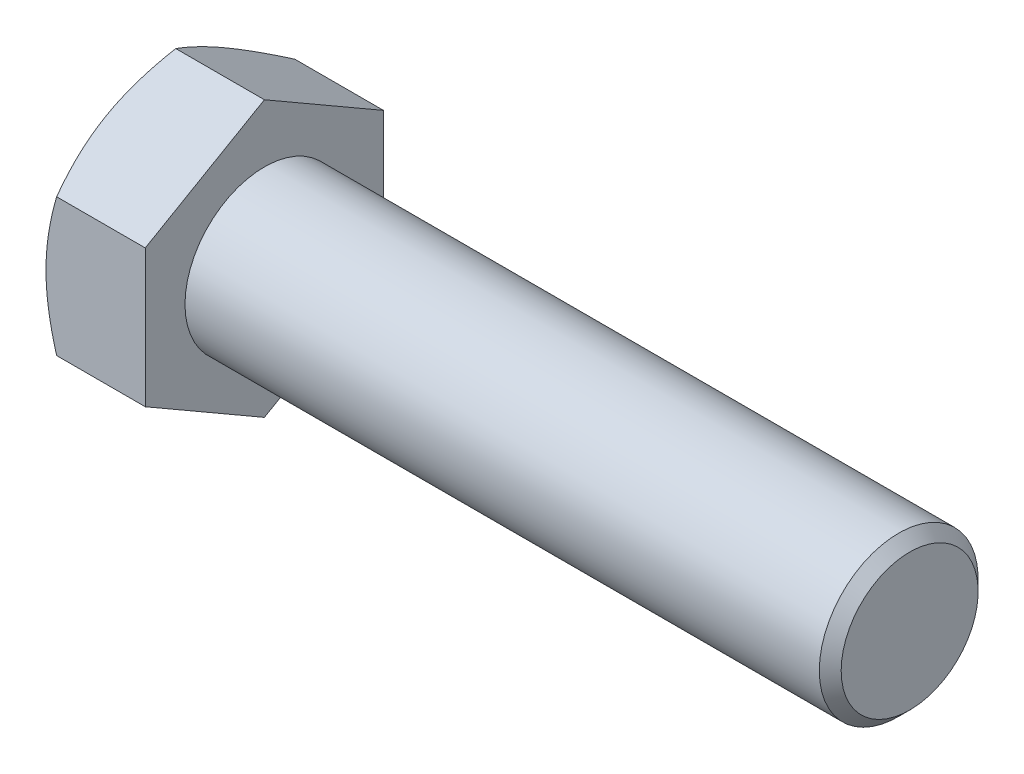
ISO-10303-21;
HEADER;
FILE_DESCRIPTION(('STEP AP214'),'2;1');
FILE_NAME('part.step','',(''),(''),'','','');
FILE_SCHEMA(('AUTOMOTIVE_DESIGN { 1 0 10303 214 1 1 1 1 }'));
ENDSEC;
DATA;
#1=APPLICATION_CONTEXT('core data for automotive mechanical design processes');
#2=APPLICATION_PROTOCOL_DEFINITION('international standard','automotive_design',2000,#1);
#3=PRODUCT_CONTEXT('',#1,'mechanical');
#4=PRODUCT('Part','Part','',(#3));
#5=PRODUCT_RELATED_PRODUCT_CATEGORY('part','',(#4));
#6=PRODUCT_DEFINITION_FORMATION('','',#4);
#7=PRODUCT_DEFINITION_CONTEXT('part definition',#1,'design');
#8=PRODUCT_DEFINITION('design','',#6,#7);
#9=PRODUCT_DEFINITION_SHAPE('','',#8);
#10=(LENGTH_UNIT() NAMED_UNIT(*) SI_UNIT(.MILLI.,.METRE.));
#11=(NAMED_UNIT(*) PLANE_ANGLE_UNIT() SI_UNIT($,.RADIAN.));
#12=(NAMED_UNIT(*) SI_UNIT($,.STERADIAN.) SOLID_ANGLE_UNIT());
#13=UNCERTAINTY_MEASURE_WITH_UNIT(LENGTH_MEASURE(1.E-05),#10,'distance_accuracy_value','');
#14=(GEOMETRIC_REPRESENTATION_CONTEXT(3) GLOBAL_UNCERTAINTY_ASSIGNED_CONTEXT((#13)) GLOBAL_UNIT_ASSIGNED_CONTEXT((#10,
#11,#12)) REPRESENTATION_CONTEXT('',''));
#15=CARTESIAN_POINT('',(0.,0.,0.));
#16=DIRECTION('',(0.,0.,1.));
#17=DIRECTION('',(1.,0.,0.));
#18=AXIS2_PLACEMENT_3D('',#15,#16,#17);
#19=CARTESIAN_POINT('',(1.11022302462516E-13,13.8564064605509,0.));
#20=DIRECTION('',(1.,0.,0.));
#21=DIRECTION('',(0.,0.,-0.999999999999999));
#22=AXIS2_PLACEMENT_3D('',#19,#20,#21);
#23=PLANE('',#22);
#24=CARTESIAN_POINT('',(0.,0.,0.));
#25=DIRECTION('',(1.,0.,0.));
#26=DIRECTION('',(0.,0.,-0.999999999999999));
#27=AXIS2_PLACEMENT_3D('',#24,#25,#26);
#28=CIRCLE('',#27,12.);
#29=CARTESIAN_POINT('',(0.,-10.3923048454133,-6.00000000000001));
#30=VERTEX_POINT('',#29);
#31=CARTESIAN_POINT('',(0.,0.,-12.));
#32=VERTEX_POINT('',#31);
#33=EDGE_CURVE('E339',#30,#32,#28,.T.);
#34=ORIENTED_EDGE('',*,*,#33,.F.);
#35=CARTESIAN_POINT('',(0.,0.,0.));
#36=DIRECTION('',(1.,0.,0.));
#37=DIRECTION('',(0.,0.,-0.999999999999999));
#38=AXIS2_PLACEMENT_3D('',#35,#36,#37);
#39=CIRCLE('',#38,12.);
#40=CARTESIAN_POINT('',(0.,-10.3923048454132,6.00000000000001));
#41=VERTEX_POINT('',#40);
#42=EDGE_CURVE('E338',#41,#30,#39,.T.);
#43=ORIENTED_EDGE('',*,*,#42,.F.);
#44=CARTESIAN_POINT('',(0.,0.,0.));
#45=DIRECTION('',(1.,0.,0.));
#46=DIRECTION('',(0.,0.,-0.999999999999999));
#47=AXIS2_PLACEMENT_3D('',#44,#45,#46);
#48=CIRCLE('',#47,12.);
#49=CARTESIAN_POINT('',(0.,0.,12.0000000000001));
#50=VERTEX_POINT('',#49);
#51=EDGE_CURVE('E88',#50,#41,#48,.T.);
#52=ORIENTED_EDGE('',*,*,#51,.F.);
#53=CARTESIAN_POINT('',(0.,0.,0.));
#54=DIRECTION('',(1.,0.,0.));
#55=DIRECTION('',(0.,0.,-0.999999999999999));
#56=AXIS2_PLACEMENT_3D('',#53,#54,#55);
#57=CIRCLE('',#56,12.);
#58=CARTESIAN_POINT('',(0.,10.3923048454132,6.00000000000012));
#59=VERTEX_POINT('',#58);
#60=EDGE_CURVE('E86',#59,#50,#57,.T.);
#61=ORIENTED_EDGE('',*,*,#60,.F.);
#62=CARTESIAN_POINT('',(0.,0.,0.));
#63=DIRECTION('',(1.,0.,0.));
#64=DIRECTION('',(0.,0.,-0.999999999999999));
#65=AXIS2_PLACEMENT_3D('',#62,#63,#64);
#66=CIRCLE('',#65,12.);
#67=CARTESIAN_POINT('',(0.,10.3923048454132,-6.00000000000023));
#68=VERTEX_POINT('',#67);
#69=EDGE_CURVE('E19',#68,#59,#66,.T.);
#70=ORIENTED_EDGE('',*,*,#69,.F.);
#71=CARTESIAN_POINT('',(0.,0.,0.));
#72=DIRECTION('',(1.,0.,0.));
#73=DIRECTION('',(0.,0.,-0.999999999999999));
#74=AXIS2_PLACEMENT_3D('',#71,#72,#73);
#75=CIRCLE('',#74,12.);
#76=EDGE_CURVE('E264',#32,#68,#75,.T.);
#77=ORIENTED_EDGE('',*,*,#76,.F.);
#78=EDGE_LOOP('',(#34,#43,#52,#61,#70,#77));
#79=FACE_BOUND('',#78,.T.);
#80=ADVANCED_FACE('F16',(#79),#23,.F.);
#81=CARTESIAN_POINT('',(1.07822755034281,0.,0.));
#82=DIRECTION('',(1.,0.,0.));
#83=DIRECTION('',(0.,0.,-0.999999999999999));
#84=AXIS2_PLACEMENT_3D('',#81,#82,#83);
#85=CONICAL_SURFACE('',#84,13.8675448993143,1.0471975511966);
#86=CARTESIAN_POINT('',(1.07179676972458,13.856406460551,0.));
#87=CARTESIAN_POINT('',(0.908940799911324,13.5743006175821,-0.488621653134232));
#88=CARTESIAN_POINT('',(0.759755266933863,13.2901242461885,-0.980829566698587));
#89=CARTESIAN_POINT('',(0.562274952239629,12.8616146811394,-1.72302990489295));
#90=CARTESIAN_POINT('',(0.500950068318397,12.7187583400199,-1.97046434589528));
#91=CARTESIAN_POINT('',(0.387776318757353,12.4321091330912,-2.46695533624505));
#92=CARTESIAN_POINT('',(0.335926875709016,12.2883163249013,-2.71601178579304));
#93=CARTESIAN_POINT('',(0.242530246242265,11.9997152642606,-3.21588348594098));
#94=CARTESIAN_POINT('',(0.200995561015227,11.8549059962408,-3.46670049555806));
#95=CARTESIAN_POINT('',(0.129101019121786,11.5645948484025,-3.96953415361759));
#96=CARTESIAN_POINT('',(0.0987408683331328,11.4190929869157,-4.2215507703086));
#97=CARTESIAN_POINT('',(0.0497242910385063,11.1268576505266,-4.72771722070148));
#98=CARTESIAN_POINT('',(0.0311273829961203,10.9801216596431,-4.98187141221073));
#99=CARTESIAN_POINT('',(0.00623934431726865,10.6863610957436,-5.49067963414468));
#100=CARTESIAN_POINT('',(-4.93491988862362E-05,10.539336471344,-5.74533375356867));
#101=CARTESIAN_POINT('',(0.,10.3923048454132,-6.00000000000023));
#102=B_SPLINE_CURVE_WITH_KNOTS('',3,(#86,#87,#88,#89,#90,#91,#92,#93,#94,#95,#96,#97,#98,#99,
#100,#101),.UNSPECIFIED.,.F.,.F.,(4,2,2,2,2,2,2,4),(0.,1.76168798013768,2.63822760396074,
3.51471379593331,4.39225713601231,5.26977737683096,6.15170281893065,7.03380287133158),.UNSPECIFIED.);
#103=CARTESIAN_POINT('',(1.07179676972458,13.856406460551,0.));
#104=VERTEX_POINT('',#103);
#105=EDGE_CURVE('E98',#104,#68,#102,.T.);
#106=ORIENTED_EDGE('',*,*,#105,.T.);
#107=ORIENTED_EDGE('',*,*,#69,.T.);
#108=CARTESIAN_POINT('',(0.,10.3923048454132,6.00000000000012));
#109=CARTESIAN_POINT('',(-4.93491989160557E-05,10.5393364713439,5.74533375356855));
#110=CARTESIAN_POINT('',(0.00623934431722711,10.6863610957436,5.49067963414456));
#111=CARTESIAN_POINT('',(0.0311273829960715,10.9801216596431,4.98187141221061));
#112=CARTESIAN_POINT('',(0.0497242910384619,11.1268576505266,4.72771722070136));
#113=CARTESIAN_POINT('',(0.0987408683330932,11.4190929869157,4.22155077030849));
#114=CARTESIAN_POINT('',(0.129101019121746,11.5645948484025,3.96953415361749));
#115=CARTESIAN_POINT('',(0.200995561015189,11.8549059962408,3.46670049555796));
#116=CARTESIAN_POINT('',(0.242530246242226,11.9997152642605,3.21588348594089));
#117=CARTESIAN_POINT('',(0.335926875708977,12.2883163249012,2.71601178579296));
#118=CARTESIAN_POINT('',(0.387776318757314,12.4321091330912,2.46695533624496));
#119=CARTESIAN_POINT('',(0.500950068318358,12.7187583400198,1.9704643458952));
#120=CARTESIAN_POINT('',(0.562274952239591,12.8616146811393,1.72302990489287));
#121=CARTESIAN_POINT('',(0.759755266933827,13.2901242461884,0.980829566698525));
#122=CARTESIAN_POINT('',(0.908940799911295,13.5743006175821,0.488621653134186));
#123=CARTESIAN_POINT('',(1.07179676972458,13.856406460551,0.));
#124=B_SPLINE_CURVE_WITH_KNOTS('',3,(#108,#109,#110,#111,#112,#113,#114,#115,#116,#117,#118,
#119,#120,#121,#122,#123),.UNSPECIFIED.,.F.,.F.,(4,2,2,2,2,2,2,4),(0.,0.882100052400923,
1.7640254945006,2.64154573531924,3.51908907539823,4.39557526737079,5.27211489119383,
7.03380287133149),.UNSPECIFIED.);
#125=EDGE_CURVE('E96',#59,#104,#124,.T.);
#126=ORIENTED_EDGE('',*,*,#125,.T.);
#127=EDGE_LOOP('',(#106,#107,#126));
#128=FACE_BOUND('',#127,.T.);
#129=ADVANCED_FACE('F94',(#128),#85,.T.);
#130=CARTESIAN_POINT('',(1.07822755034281,0.,0.));
#131=DIRECTION('',(1.,0.,0.));
#132=DIRECTION('',(0.,0.,-0.999999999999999));
#133=AXIS2_PLACEMENT_3D('',#130,#131,#132);
#134=CONICAL_SURFACE('',#133,13.8675448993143,1.0471975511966);
#135=CARTESIAN_POINT('',(1.07179676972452,6.92820323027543,11.9999999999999));
#136=CARTESIAN_POINT('',(0.90894079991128,7.21030907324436,11.5113783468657));
#137=CARTESIAN_POINT('',(0.759755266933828,7.494485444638,11.0191704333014));
#138=CARTESIAN_POINT('',(0.562274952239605,7.92299500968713,10.2769700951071));
#139=CARTESIAN_POINT('',(0.500950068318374,8.0658513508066,10.0295356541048));
#140=CARTESIAN_POINT('',(0.387776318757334,8.35250055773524,9.53304466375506));
#141=CARTESIAN_POINT('',(0.335926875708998,8.49629336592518,9.28398821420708));
#142=CARTESIAN_POINT('',(0.242530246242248,8.78489442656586,8.78411651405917));
#143=CARTESIAN_POINT('',(0.200995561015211,8.92970369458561,8.53329950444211));
#144=CARTESIAN_POINT('',(0.129101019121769,9.22001484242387,8.0304658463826));
#145=CARTESIAN_POINT('',(0.0987408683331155,9.36551670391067,7.77844922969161));
#146=CARTESIAN_POINT('',(0.0497242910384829,9.65775204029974,7.27228277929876));
#147=CARTESIAN_POINT('',(0.0311273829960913,9.80448803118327,7.01812858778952));
#148=CARTESIAN_POINT('',(0.00623934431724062,10.0982485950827,6.5093203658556));
#149=CARTESIAN_POINT('',(-4.93491989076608E-05,10.2452732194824,6.25466624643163));
#150=CARTESIAN_POINT('',(0.,10.3923048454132,6.00000000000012));
#151=B_SPLINE_CURVE_WITH_KNOTS('',3,(#135,#136,#137,#138,#139,#140,#141,#142,#143,#144,#145,
#146,#147,#148,#149,#150),.UNSPECIFIED.,.F.,.F.,(4,2,2,2,2,2,2,4),(0.,1.76168798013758,
2.63822760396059,3.51471379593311,4.39225713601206,5.26977737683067,6.15170281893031,
7.03380287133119),.UNSPECIFIED.);
#152=CARTESIAN_POINT('',(1.07179676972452,6.92820323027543,11.9999999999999));
#153=VERTEX_POINT('',#152);
#154=EDGE_CURVE('E101',#153,#59,#151,.T.);
#155=ORIENTED_EDGE('',*,*,#154,.T.);
#156=ORIENTED_EDGE('',*,*,#60,.T.);
#157=CARTESIAN_POINT('',(0.,0.,12.0000000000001));
#158=CARTESIAN_POINT('',(-4.93491989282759E-05,0.294063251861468,12.));
#159=CARTESIAN_POINT('',(0.00623934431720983,0.588112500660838,11.9999999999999));
#160=CARTESIAN_POINT('',(0.0311273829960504,1.17563362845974,11.9999999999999));
#161=CARTESIAN_POINT('',(0.0497242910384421,1.46910561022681,11.9999999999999));
#162=CARTESIAN_POINT('',(0.0987408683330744,2.05357628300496,11.9999999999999));
#163=CARTESIAN_POINT('',(0.129101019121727,2.34458000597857,11.9999999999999));
#164=CARTESIAN_POINT('',(0.200995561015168,2.9252023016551,11.9999999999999));
#165=CARTESIAN_POINT('',(0.242530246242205,3.21482083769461,11.9999999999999));
#166=CARTESIAN_POINT('',(0.335926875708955,3.79202295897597,11.9999999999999));
#167=CARTESIAN_POINT('',(0.387776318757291,4.07960857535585,11.9999999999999));
#168=CARTESIAN_POINT('',(0.500950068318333,4.65290698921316,11.9999999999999));
#169=CARTESIAN_POINT('',(0.562274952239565,4.93861967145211,11.9999999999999));
#170=CARTESIAN_POINT('',(0.759755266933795,5.79563880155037,11.9999999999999));
#171=CARTESIAN_POINT('',(0.908940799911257,6.36399154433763,11.9999999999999));
#172=CARTESIAN_POINT('',(1.07179676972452,6.92820323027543,11.9999999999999));
#173=B_SPLINE_CURVE_WITH_KNOTS('',3,(#157,#158,#159,#160,#161,#162,#163,#164,#165,#166,#167,
#168,#169,#170,#171,#172),.UNSPECIFIED.,.F.,.F.,(4,2,2,2,2,2,2,4),(0.,0.882100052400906,
1.76402549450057,2.64154573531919,3.51908907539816,4.3955752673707,5.27211489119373,
7.03380287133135),.UNSPECIFIED.);
#174=EDGE_CURVE('E104',#50,#153,#173,.T.);
#175=ORIENTED_EDGE('',*,*,#174,.T.);
#176=EDGE_LOOP('',(#155,#156,#175));
#177=FACE_BOUND('',#176,.T.);
#178=ADVANCED_FACE('F102',(#177),#134,.T.);
#179=CARTESIAN_POINT('',(1.07822755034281,0.,0.));
#180=DIRECTION('',(1.,0.,0.));
#181=DIRECTION('',(0.,0.,-0.999999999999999));
#182=AXIS2_PLACEMENT_3D('',#179,#180,#181);
#183=CONICAL_SURFACE('',#182,13.8675448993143,1.0471975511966);
#184=ORIENTED_EDGE('',*,*,#51,.T.);
#185=CARTESIAN_POINT('',(0.,-10.3923048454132,6.00000000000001));
#186=CARTESIAN_POINT('',(-4.93491988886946E-05,-10.2452732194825,6.25466624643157));
#187=CARTESIAN_POINT('',(0.00623934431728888,-10.0982485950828,6.50932036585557));
#188=CARTESIAN_POINT('',(0.0311273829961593,-9.80448803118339,7.01812858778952));
#189=CARTESIAN_POINT('',(0.0497242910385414,-9.65775204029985,7.27228277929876));
#190=CARTESIAN_POINT('',(0.0987408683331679,-9.36551670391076,7.77844922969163));
#191=CARTESIAN_POINT('',(0.129101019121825,-9.22001484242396,8.03046584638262));
#192=CARTESIAN_POINT('',(0.20099556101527,-8.92970369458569,8.53329950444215));
#193=CARTESIAN_POINT('',(0.242530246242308,-8.78489442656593,8.78411651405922));
#194=CARTESIAN_POINT('',(0.335926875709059,-8.49629336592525,9.28398821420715));
#195=CARTESIAN_POINT('',(0.387776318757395,-8.3525005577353,9.53304466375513));
#196=CARTESIAN_POINT('',(0.500950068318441,-8.06585135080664,10.0295356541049));
#197=CARTESIAN_POINT('',(0.562274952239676,-7.92299500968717,10.2769700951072));
#198=CARTESIAN_POINT('',(0.759755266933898,-7.49448544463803,11.0191704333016));
#199=CARTESIAN_POINT('',(0.908940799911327,-7.2103090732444,11.5113783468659));
#200=CARTESIAN_POINT('',(1.07179676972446,-6.92820323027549,12.0000000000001));
#201=B_SPLINE_CURVE_WITH_KNOTS('',3,(#185,#186,#187,#188,#189,#190,#191,#192,#193,#194,#195,
#196,#197,#198,#199,#200),.UNSPECIFIED.,.F.,.F.,(4,2,2,2,2,2,2,4),(0.,0.882100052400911,
1.76402549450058,2.64154573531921,3.51908907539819,4.39557526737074,5.27211489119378,
7.03380287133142),.UNSPECIFIED.);
#202=CARTESIAN_POINT('',(1.07179676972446,-6.92820323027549,12.0000000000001));
#203=VERTEX_POINT('',#202);
#204=EDGE_CURVE('E179',#41,#203,#201,.T.);
#205=ORIENTED_EDGE('',*,*,#204,.T.);
#206=CARTESIAN_POINT('',(1.07179676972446,-6.92820323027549,12.0000000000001));
#207=CARTESIAN_POINT('',(0.908940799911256,-6.36399154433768,12.));
#208=CARTESIAN_POINT('',(0.759755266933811,-5.79563880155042,11.9999999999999));
#209=CARTESIAN_POINT('',(0.562274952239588,-4.93861967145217,11.9999999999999));
#210=CARTESIAN_POINT('',(0.500950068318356,-4.65290698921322,11.9999999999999));
#211=CARTESIAN_POINT('',(0.387776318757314,-4.07960857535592,11.9999999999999));
#212=CARTESIAN_POINT('',(0.335926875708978,-3.79202295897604,11.9999999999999));
#213=CARTESIAN_POINT('',(0.242530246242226,-3.21482083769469,11.9999999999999));
#214=CARTESIAN_POINT('',(0.200995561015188,-2.92520230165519,11.9999999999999));
#215=CARTESIAN_POINT('',(0.129101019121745,-2.34458000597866,11.9999999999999));
#216=CARTESIAN_POINT('',(0.098740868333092,-2.05357628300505,11.9999999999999));
#217=CARTESIAN_POINT('',(0.0497242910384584,-1.4691056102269,11.9999999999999));
#218=CARTESIAN_POINT('',(0.0311273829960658,-1.17563362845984,11.9999999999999));
#219=CARTESIAN_POINT('',(0.00623934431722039,-0.588112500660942,11.9999999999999));
#220=CARTESIAN_POINT('',(-4.93491989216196E-05,-0.294063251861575,12.));
#221=CARTESIAN_POINT('',(0.,0.,12.0000000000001));
#222=B_SPLINE_CURVE_WITH_KNOTS('',3,(#206,#207,#208,#209,#210,#211,#212,#213,#214,#215,#216,
#217,#218,#219,#220,#221),.UNSPECIFIED.,.F.,.F.,(4,2,2,2,2,2,2,4),(0.,1.7616879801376,
2.63822760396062,3.51471379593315,4.39225713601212,5.26977737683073,6.15170281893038,
7.03380287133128),.UNSPECIFIED.);
#223=EDGE_CURVE('E151',#203,#50,#222,.T.);
#224=ORIENTED_EDGE('',*,*,#223,.T.);
#225=EDGE_LOOP('',(#184,#205,#224));
#226=FACE_BOUND('',#225,.T.);
#227=ADVANCED_FACE('F141',(#226),#183,.T.);
#228=CARTESIAN_POINT('',(1.07822755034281,0.,0.));
#229=DIRECTION('',(1.,0.,0.));
#230=DIRECTION('',(0.,0.,-0.999999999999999));
#231=AXIS2_PLACEMENT_3D('',#228,#229,#230);
#232=CONICAL_SURFACE('',#231,13.8675448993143,1.0471975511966);
#233=ORIENTED_EDGE('',*,*,#42,.T.);
#234=CARTESIAN_POINT('',(0.,-10.3923048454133,-6.00000000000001));
#235=CARTESIAN_POINT('',(-4.93491989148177E-05,-10.539336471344,-5.74533375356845));
#236=CARTESIAN_POINT('',(0.00623934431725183,-10.6863610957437,-5.49067963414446));
#237=CARTESIAN_POINT('',(0.0311273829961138,-10.9801216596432,-4.98187141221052));
#238=CARTESIAN_POINT('',(0.0497242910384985,-11.1268576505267,-4.72771722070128));
#239=CARTESIAN_POINT('',(0.0987408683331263,-11.4190929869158,-4.22155077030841));
#240=CARTESIAN_POINT('',(0.129101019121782,-11.5645948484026,-3.96953415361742));
#241=CARTESIAN_POINT('',(0.200995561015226,-11.8549059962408,-3.4667004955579));
#242=CARTESIAN_POINT('',(0.242530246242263,-11.9997152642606,-3.21588348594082));
#243=CARTESIAN_POINT('',(0.335926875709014,-12.2883163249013,-2.7160117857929));
#244=CARTESIAN_POINT('',(0.38777631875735,-12.4321091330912,-2.46695533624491));
#245=CARTESIAN_POINT('',(0.500950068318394,-12.7187583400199,-1.97046434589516));
#246=CARTESIAN_POINT('',(0.562274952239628,-12.8616146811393,-1.72302990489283));
#247=CARTESIAN_POINT('',(0.759755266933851,-13.2901242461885,-0.980829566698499));
#248=CARTESIAN_POINT('',(0.908940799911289,-13.5743006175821,-0.488621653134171));
#249=CARTESIAN_POINT('',(1.07179676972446,-13.8564064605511,0.));
#250=B_SPLINE_CURVE_WITH_KNOTS('',3,(#234,#235,#236,#237,#238,#239,#240,#241,#242,#243,#244,
#245,#246,#247,#248,#249),.UNSPECIFIED.,.F.,.F.,(4,2,2,2,2,2,2,4),(0.,0.882100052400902,
1.76402549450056,2.64154573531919,3.51908907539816,4.3955752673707,5.27211489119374,
7.03380287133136),.UNSPECIFIED.);
#251=CARTESIAN_POINT('',(1.07179676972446,-13.8564064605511,0.));
#252=VERTEX_POINT('',#251);
#253=EDGE_CURVE('E311',#30,#252,#250,.T.);
#254=ORIENTED_EDGE('',*,*,#253,.T.);
#255=CARTESIAN_POINT('',(1.07179676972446,-13.8564064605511,0.));
#256=CARTESIAN_POINT('',(0.908940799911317,-13.5743006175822,0.488621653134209));
#257=CARTESIAN_POINT('',(0.759755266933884,-13.2901242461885,0.980829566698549));
#258=CARTESIAN_POINT('',(0.562274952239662,-12.8616146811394,1.72302990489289));
#259=CARTESIAN_POINT('',(0.500950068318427,-12.7187583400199,1.97046434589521));
#260=CARTESIAN_POINT('',(0.387776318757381,-12.4321091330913,2.46695533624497));
#261=CARTESIAN_POINT('',(0.335926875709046,-12.2883163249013,2.71601178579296));
#262=CARTESIAN_POINT('',(0.242530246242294,-11.9997152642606,3.21588348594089));
#263=CARTESIAN_POINT('',(0.200995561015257,-11.8549059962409,3.46670049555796));
#264=CARTESIAN_POINT('',(0.129101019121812,-11.5645948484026,3.96953415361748));
#265=CARTESIAN_POINT('',(0.0987408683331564,-11.4190929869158,4.22155077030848));
#266=CARTESIAN_POINT('',(0.04972429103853,-11.1268576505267,4.72771722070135));
#267=CARTESIAN_POINT('',(0.031127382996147,-10.9801216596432,4.9818714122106));
#268=CARTESIAN_POINT('',(0.00623934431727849,-10.6863610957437,5.49067963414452));
#269=CARTESIAN_POINT('',(-4.93491988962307E-05,-10.539336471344,5.7453337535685));
#270=CARTESIAN_POINT('',(0.,-10.3923048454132,6.00000000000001));
#271=B_SPLINE_CURVE_WITH_KNOTS('',3,(#255,#256,#257,#258,#259,#260,#261,#262,#263,#264,#265,
#266,#267,#268,#269,#270),.UNSPECIFIED.,.F.,.F.,(4,2,2,2,2,2,2,4),(0.,1.76168798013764,
2.63822760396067,3.51471379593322,4.3922571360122,5.26977737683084,6.1517028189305,
7.03380287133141),.UNSPECIFIED.);
#272=EDGE_CURVE('E173',#252,#41,#271,.T.);
#273=ORIENTED_EDGE('',*,*,#272,.T.);
#274=EDGE_LOOP('',(#233,#254,#273));
#275=FACE_BOUND('',#274,.T.);
#276=ADVANCED_FACE('F329',(#275),#232,.T.);
#277=CARTESIAN_POINT('',(1.07822755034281,0.,0.));
#278=DIRECTION('',(1.,0.,0.));
#279=DIRECTION('',(0.,0.,-0.999999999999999));
#280=AXIS2_PLACEMENT_3D('',#277,#278,#279);
#281=CONICAL_SURFACE('',#280,13.8675448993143,1.0471975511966);
#282=ORIENTED_EDGE('',*,*,#33,.T.);
#283=CARTESIAN_POINT('',(0.,0.,-12.));
#284=CARTESIAN_POINT('',(-4.93491989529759E-05,-0.294063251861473,-11.9999999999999));
#285=CARTESIAN_POINT('',(0.00623934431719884,-0.588112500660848,-11.9999999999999));
#286=CARTESIAN_POINT('',(0.0311273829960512,-1.17563362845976,-11.9999999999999));
#287=CARTESIAN_POINT('',(0.0497242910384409,-1.46910561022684,-11.9999999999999));
#288=CARTESIAN_POINT('',(0.0987408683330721,-2.05357628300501,-11.9999999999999));
#289=CARTESIAN_POINT('',(0.129101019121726,-2.34458000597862,-11.9999999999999));
#290=CARTESIAN_POINT('',(0.20099556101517,-2.92520230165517,-11.9999999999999));
#291=CARTESIAN_POINT('',(0.242530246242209,-3.21482083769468,-11.9999999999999));
#292=CARTESIAN_POINT('',(0.335926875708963,-3.79202295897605,-11.9999999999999));
#293=CARTESIAN_POINT('',(0.387776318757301,-4.07960857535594,-11.9999999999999));
#294=CARTESIAN_POINT('',(0.500950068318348,-4.65290698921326,-11.9999999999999));
#295=CARTESIAN_POINT('',(0.562274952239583,-4.93861967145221,-11.9999999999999));
#296=CARTESIAN_POINT('',(0.759755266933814,-5.79563880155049,-11.9999999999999));
#297=CARTESIAN_POINT('',(0.908940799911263,-6.36399154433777,-12.));
#298=CARTESIAN_POINT('',(1.07179676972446,-6.9282032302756,-12.0000000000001));
#299=B_SPLINE_CURVE_WITH_KNOTS('',3,(#283,#284,#285,#286,#287,#288,#289,#290,#291,#292,#293,
#294,#295,#296,#297,#298),.UNSPECIFIED.,.F.,.F.,(4,2,2,2,2,2,2,4),(0.,0.882100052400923,
1.7640254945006,2.64154573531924,3.51908907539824,4.39557526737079,5.27211489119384,
7.0338028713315),.UNSPECIFIED.);
#300=CARTESIAN_POINT('',(1.07179676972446,-6.9282032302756,-12.0000000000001));
#301=VERTEX_POINT('',#300);
#302=EDGE_CURVE('E240',#32,#301,#299,.T.);
#303=ORIENTED_EDGE('',*,*,#302,.T.);
#304=CARTESIAN_POINT('',(1.07179676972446,-6.9282032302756,-12.0000000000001));
#305=CARTESIAN_POINT('',(0.90894079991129,-7.21030907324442,-11.5113783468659));
#306=CARTESIAN_POINT('',(0.759755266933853,-7.49448544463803,-11.0191704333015));
#307=CARTESIAN_POINT('',(0.562274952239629,-7.92299500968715,-10.2769700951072));
#308=CARTESIAN_POINT('',(0.500950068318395,-8.06585135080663,-10.0295356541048));
#309=CARTESIAN_POINT('',(0.387776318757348,-8.35250055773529,-9.53304466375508));
#310=CARTESIAN_POINT('',(0.335926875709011,-8.49629336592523,-9.28398821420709));
#311=CARTESIAN_POINT('',(0.242530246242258,-8.78489442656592,-8.78411651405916));
#312=CARTESIAN_POINT('',(0.200995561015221,-8.92970369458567,-8.53329950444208));
#313=CARTESIAN_POINT('',(0.129101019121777,-9.22001484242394,-8.03046584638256));
#314=CARTESIAN_POINT('',(0.0987408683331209,-9.36551670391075,-7.77844922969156));
#315=CARTESIAN_POINT('',(0.0497242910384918,-9.65775204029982,-7.27228277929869));
#316=CARTESIAN_POINT('',(0.031127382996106,-9.80448803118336,-7.01812858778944));
#317=CARTESIAN_POINT('',(0.00623934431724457,-10.0982485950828,-6.50932036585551));
#318=CARTESIAN_POINT('',(-4.93491989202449E-05,-10.2452732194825,-6.25466624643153));
#319=CARTESIAN_POINT('',(0.,-10.3923048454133,-6.00000000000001));
#320=B_SPLINE_CURVE_WITH_KNOTS('',3,(#304,#305,#306,#307,#308,#309,#310,#311,#312,#313,#314,
#315,#316,#317,#318,#319),.UNSPECIFIED.,.F.,.F.,(4,2,2,2,2,2,2,4),(0.,1.76168798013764,
2.63822760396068,3.51471379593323,4.39225713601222,5.26977737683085,6.15170281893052,
7.03380287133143),.UNSPECIFIED.);
#321=EDGE_CURVE('E310',#301,#30,#320,.T.);
#322=ORIENTED_EDGE('',*,*,#321,.T.);
#323=EDGE_LOOP('',(#282,#303,#322));
#324=FACE_BOUND('',#323,.T.);
#325=ADVANCED_FACE('F255',(#324),#281,.T.);
#326=CARTESIAN_POINT('',(1.07822755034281,0.,0.));
#327=DIRECTION('',(1.,0.,0.));
#328=DIRECTION('',(0.,0.,-0.999999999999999));
#329=AXIS2_PLACEMENT_3D('',#326,#327,#328);
#330=CONICAL_SURFACE('',#329,13.8675448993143,1.0471975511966);
#331=CARTESIAN_POINT('',(1.07179676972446,6.9282032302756,-11.9999999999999));
#332=CARTESIAN_POINT('',(0.908940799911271,6.36399154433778,-11.9999999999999));
#333=CARTESIAN_POINT('',(0.759755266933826,5.79563880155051,-11.9999999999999));
#334=CARTESIAN_POINT('',(0.562274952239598,4.93861967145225,-11.9999999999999));
#335=CARTESIAN_POINT('',(0.500950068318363,4.6529069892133,-11.9999999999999));
#336=CARTESIAN_POINT('',(0.387776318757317,4.07960857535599,-11.9999999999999));
#337=CARTESIAN_POINT('',(0.335926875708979,3.7920229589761,-11.9999999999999));
#338=CARTESIAN_POINT('',(0.242530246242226,3.21482083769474,-11.9999999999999));
#339=CARTESIAN_POINT('',(0.200995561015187,2.92520230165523,-11.9999999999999));
#340=CARTESIAN_POINT('',(0.129101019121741,2.34458000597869,-11.9999999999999));
#341=CARTESIAN_POINT('',(0.0987408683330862,2.05357628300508,-11.9999999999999));
#342=CARTESIAN_POINT('',(0.0497242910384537,1.46910561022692,-11.9999999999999));
#343=CARTESIAN_POINT('',(0.0311273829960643,1.17563362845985,-11.9999999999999));
#344=CARTESIAN_POINT('',(0.00623934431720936,0.588112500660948,-11.9999999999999));
#345=CARTESIAN_POINT('',(-4.93491989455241E-05,0.294063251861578,-11.9999999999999));
#346=CARTESIAN_POINT('',(0.,0.,-12.));
#347=B_SPLINE_CURVE_WITH_KNOTS('',3,(#331,#332,#333,#334,#335,#336,#337,#338,#339,#340,#341,
#342,#343,#344,#345,#346),.UNSPECIFIED.,.F.,.F.,(4,2,2,2,2,2,2,4),(0.,1.76168798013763,
2.63822760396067,3.51471379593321,4.39225713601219,5.26977737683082,6.15170281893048,
7.03380287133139),.UNSPECIFIED.);
#348=CARTESIAN_POINT('',(1.07179676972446,6.9282032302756,-11.9999999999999));
#349=VERTEX_POINT('',#348);
#350=EDGE_CURVE('E231',#349,#32,#347,.T.);
#351=ORIENTED_EDGE('',*,*,#350,.T.);
#352=ORIENTED_EDGE('',*,*,#76,.T.);
#353=CARTESIAN_POINT('',(0.,10.3923048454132,-6.00000000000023));
#354=CARTESIAN_POINT('',(-4.93491988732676E-05,10.2452732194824,-6.25466624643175));
#355=CARTESIAN_POINT('',(0.006239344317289,10.0982485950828,-6.50932036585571));
#356=CARTESIAN_POINT('',(0.0311273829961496,9.80448803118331,-7.01812858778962));
#357=CARTESIAN_POINT('',(0.0497242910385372,9.65775204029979,-7.27228277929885));
#358=CARTESIAN_POINT('',(0.0987408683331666,9.36551670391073,-7.77844922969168));
#359=CARTESIAN_POINT('',(0.129101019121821,9.22001484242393,-8.03046584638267));
#360=CARTESIAN_POINT('',(0.200995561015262,8.92970369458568,-8.53329950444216));
#361=CARTESIAN_POINT('',(0.242530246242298,8.78489442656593,-8.78411651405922));
#362=CARTESIAN_POINT('',(0.335926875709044,8.49629336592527,-9.28398821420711));
#363=CARTESIAN_POINT('',(0.387776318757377,8.35250055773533,-9.53304466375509));
#364=CARTESIAN_POINT('',(0.500950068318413,8.06585135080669,-10.0295356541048));
#365=CARTESIAN_POINT('',(0.562274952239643,7.92299500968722,-10.2769700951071));
#366=CARTESIAN_POINT('',(0.759755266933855,7.49448544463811,-11.0191704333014));
#367=CARTESIAN_POINT('',(0.908940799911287,7.21030907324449,-11.5113783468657));
#368=CARTESIAN_POINT('',(1.07179676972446,6.9282032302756,-11.9999999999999));
#369=B_SPLINE_CURVE_WITH_KNOTS('',3,(#353,#354,#355,#356,#357,#358,#359,#360,#361,#362,#363,
#364,#365,#366,#367,#368),.UNSPECIFIED.,.F.,.F.,(4,2,2,2,2,2,2,4),(0.,0.882100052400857,
1.76402549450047,2.64154573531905,3.51908907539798,4.39557526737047,5.27211489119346,
7.03380287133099),.UNSPECIFIED.);
#370=EDGE_CURVE('E114',#68,#349,#369,.T.);
#371=ORIENTED_EDGE('',*,*,#370,.T.);
#372=EDGE_LOOP('',(#351,#352,#371));
#373=FACE_BOUND('',#372,.T.);
#374=ADVANCED_FACE('F250',(#373),#330,.T.);
#375=CARTESIAN_POINT('',(75.,0.,0.));
#376=DIRECTION('',(-1.,0.,0.));
#377=DIRECTION('',(0.,0.,0.999999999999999));
#378=AXIS2_PLACEMENT_3D('',#375,#376,#377);
#379=PLANE('',#378);
#380=CARTESIAN_POINT('',(74.9999999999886,0.,0.));
#381=DIRECTION('',(-1.,0.,0.));
#382=DIRECTION('',(0.,0.,0.999999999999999));
#383=AXIS2_PLACEMENT_3D('',#380,#381,#382);
#384=CIRCLE('',#383,6.89850000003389);
#385=CARTESIAN_POINT('',(74.9999999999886,0.,6.89850000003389));
#386=VERTEX_POINT('',#385);
#387=EDGE_CURVE('E202',#386,#386,#384,.T.);
#388=ORIENTED_EDGE('',*,*,#387,.F.);
#389=EDGE_LOOP('',(#388));
#390=FACE_BOUND('',#389,.T.);
#391=ADVANCED_FACE('F254',(#390),#379,.F.);
#392=CARTESIAN_POINT('',(10.,6.9282032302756,-11.9999999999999));
#393=DIRECTION('',(0.,-0.866025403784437,0.500000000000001));
#394=DIRECTION('',(0.,-0.500000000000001,-0.866025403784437));
#395=AXIS2_PLACEMENT_3D('',#392,#393,#394);
#396=PLANE('',#395);
#397=DIRECTION('',(1.,0.,0.));
#398=VECTOR('',#397,1.);
#399=CARTESIAN_POINT('',(10.0000000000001,13.856406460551,0.));
#400=LINE('',#399,#398);
#401=CARTESIAN_POINT('',(10.0000000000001,13.856406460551,0.));
#402=VERTEX_POINT('',#401);
#403=EDGE_CURVE('E107',#104,#402,#400,.T.);
#404=ORIENTED_EDGE('',*,*,#403,.T.);
#405=DIRECTION('',(0.,0.500000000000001,0.866025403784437));
#406=VECTOR('',#405,1.);
#407=CARTESIAN_POINT('',(10.,6.9282032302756,-11.9999999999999));
#408=LINE('',#407,#406);
#409=CARTESIAN_POINT('',(10.,6.9282032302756,-11.9999999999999));
#410=VERTEX_POINT('',#409);
#411=EDGE_CURVE('E198',#410,#402,#408,.T.);
#412=ORIENTED_EDGE('',*,*,#411,.F.);
#413=DIRECTION('',(1.,0.,0.));
#414=VECTOR('',#413,1.);
#415=CARTESIAN_POINT('',(10.,6.9282032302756,-11.9999999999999));
#416=LINE('',#415,#414);
#417=EDGE_CURVE('E239',#410,#349,#416,.F.);
#418=ORIENTED_EDGE('',*,*,#417,.T.);
#419=ORIENTED_EDGE('',*,*,#370,.F.);
#420=ORIENTED_EDGE('',*,*,#105,.F.);
#421=EDGE_LOOP('',(#404,#412,#418,#419,#420));
#422=FACE_BOUND('',#421,.T.);
#423=ADVANCED_FACE('F266',(#422),#396,.F.);
#424=CARTESIAN_POINT('',(10.0000000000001,13.856406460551,0.));
#425=DIRECTION('',(0.,-0.866025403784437,-0.500000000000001));
#426=DIRECTION('',(0.,0.500000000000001,-0.866025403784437));
#427=AXIS2_PLACEMENT_3D('',#424,#425,#426);
#428=PLANE('',#427);
#429=DIRECTION('',(-1.,0.,0.));
#430=VECTOR('',#429,1.);
#431=CARTESIAN_POINT('',(10.0000000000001,6.92820323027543,11.9999999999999));
#432=LINE('',#431,#430);
#433=CARTESIAN_POINT('',(10.0000000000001,6.92820323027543,11.9999999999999));
#434=VERTEX_POINT('',#433);
#435=EDGE_CURVE('E150',#153,#434,#432,.F.);
#436=ORIENTED_EDGE('',*,*,#435,.T.);
#437=DIRECTION('',(0.,-0.500000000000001,0.866025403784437));
#438=VECTOR('',#437,1.);
#439=CARTESIAN_POINT('',(10.0000000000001,13.856406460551,0.));
#440=LINE('',#439,#438);
#441=EDGE_CURVE('E201',#402,#434,#440,.T.);
#442=ORIENTED_EDGE('',*,*,#441,.F.);
#443=ORIENTED_EDGE('',*,*,#403,.F.);
#444=ORIENTED_EDGE('',*,*,#125,.F.);
#445=ORIENTED_EDGE('',*,*,#154,.F.);
#446=EDGE_LOOP('',(#436,#442,#443,#444,#445));
#447=FACE_BOUND('',#446,.T.);
#448=ADVANCED_FACE('F110',(#447),#428,.F.);
#449=CARTESIAN_POINT('',(10.0000000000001,6.92820323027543,11.9999999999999));
#450=DIRECTION('',(0.,0.,-0.999999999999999));
#451=DIRECTION('',(-1.,0.,0.));
#452=AXIS2_PLACEMENT_3D('',#449,#450,#451);
#453=PLANE('',#452);
#454=DIRECTION('',(1.,0.,0.));
#455=VECTOR('',#454,1.);
#456=CARTESIAN_POINT('',(10.,-6.92820323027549,12.0000000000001));
#457=LINE('',#456,#455);
#458=CARTESIAN_POINT('',(10.,-6.92820323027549,12.0000000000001));
#459=VERTEX_POINT('',#458);
#460=EDGE_CURVE('E184',#203,#459,#457,.T.);
#461=ORIENTED_EDGE('',*,*,#460,.T.);
#462=DIRECTION('',(0.,0.999999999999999,0.));
#463=VECTOR('',#462,1.);
#464=CARTESIAN_POINT('',(10.0000000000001,13.856406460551,12.));
#465=LINE('',#464,#463);
#466=EDGE_CURVE('E218',#434,#459,#465,.F.);
#467=ORIENTED_EDGE('',*,*,#466,.F.);
#468=ORIENTED_EDGE('',*,*,#435,.F.);
#469=ORIENTED_EDGE('',*,*,#174,.F.);
#470=ORIENTED_EDGE('',*,*,#223,.F.);
#471=EDGE_LOOP('',(#461,#467,#468,#469,#470));
#472=FACE_BOUND('',#471,.T.);
#473=ADVANCED_FACE('F157',(#472),#453,.F.);
#474=CARTESIAN_POINT('',(10.,-13.8564064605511,0.));
#475=DIRECTION('',(0.,0.866025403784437,-0.500000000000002));
#476=DIRECTION('',(0.,0.500000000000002,0.866025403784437));
#477=AXIS2_PLACEMENT_3D('',#474,#475,#476);
#478=PLANE('',#477);
#479=DIRECTION('',(1.,0.,0.));
#480=VECTOR('',#479,1.);
#481=CARTESIAN_POINT('',(10.,-13.8564064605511,0.));
#482=LINE('',#481,#480);
#483=CARTESIAN_POINT('',(10.,-13.8564064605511,0.));
#484=VERTEX_POINT('',#483);
#485=EDGE_CURVE('E308',#252,#484,#482,.T.);
#486=ORIENTED_EDGE('',*,*,#485,.T.);
#487=DIRECTION('',(0.,-0.500000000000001,-0.866025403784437));
#488=VECTOR('',#487,1.);
#489=CARTESIAN_POINT('',(10.,-6.92820323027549,12.0000000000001));
#490=LINE('',#489,#488);
#491=EDGE_CURVE('E213',#459,#484,#490,.T.);
#492=ORIENTED_EDGE('',*,*,#491,.F.);
#493=ORIENTED_EDGE('',*,*,#460,.F.);
#494=ORIENTED_EDGE('',*,*,#204,.F.);
#495=ORIENTED_EDGE('',*,*,#272,.F.);
#496=EDGE_LOOP('',(#486,#492,#493,#494,#495));
#497=FACE_BOUND('',#496,.T.);
#498=ADVANCED_FACE('F161',(#497),#478,.F.);
#499=CARTESIAN_POINT('',(10.,-6.92820323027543,-12.0000000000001));
#500=DIRECTION('',(0.,0.866025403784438,0.499999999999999));
#501=DIRECTION('',(0.,-0.499999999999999,0.866025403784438));
#502=AXIS2_PLACEMENT_3D('',#499,#500,#501);
#503=PLANE('',#502);
#504=DIRECTION('',(1.,0.,0.));
#505=VECTOR('',#504,1.);
#506=CARTESIAN_POINT('',(10.,-6.92820323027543,-12.0000000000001));
#507=LINE('',#506,#505);
#508=CARTESIAN_POINT('',(10.,-6.92820323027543,-12.0000000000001));
#509=VERTEX_POINT('',#508);
#510=EDGE_CURVE('E34',#301,#509,#507,.T.);
#511=ORIENTED_EDGE('',*,*,#510,.T.);
#512=DIRECTION('',(0.,0.499999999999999,-0.866025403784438));
#513=VECTOR('',#512,1.);
#514=CARTESIAN_POINT('',(10.,-13.8564064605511,0.));
#515=LINE('',#514,#513);
#516=EDGE_CURVE('E208',#484,#509,#515,.T.);
#517=ORIENTED_EDGE('',*,*,#516,.F.);
#518=ORIENTED_EDGE('',*,*,#485,.F.);
#519=ORIENTED_EDGE('',*,*,#253,.F.);
#520=ORIENTED_EDGE('',*,*,#321,.F.);
#521=EDGE_LOOP('',(#511,#517,#518,#519,#520));
#522=FACE_BOUND('',#521,.T.);
#523=ADVANCED_FACE('F167',(#522),#503,.F.);
#524=CARTESIAN_POINT('',(10.,6.9282032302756,-11.9999999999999));
#525=DIRECTION('',(0.,0.,0.999999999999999));
#526=DIRECTION('',(0.,-0.999999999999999,0.));
#527=AXIS2_PLACEMENT_3D('',#524,#525,#526);
#528=PLANE('',#527);
#529=ORIENTED_EDGE('',*,*,#417,.F.);
#530=DIRECTION('',(0.,0.999999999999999,0.));
#531=VECTOR('',#530,1.);
#532=CARTESIAN_POINT('',(10.0000000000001,13.856406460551,-11.9999999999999));
#533=LINE('',#532,#531);
#534=EDGE_CURVE('E205',#509,#410,#533,.T.);
#535=ORIENTED_EDGE('',*,*,#534,.F.);
#536=ORIENTED_EDGE('',*,*,#510,.F.);
#537=ORIENTED_EDGE('',*,*,#302,.F.);
#538=ORIENTED_EDGE('',*,*,#350,.F.);
#539=EDGE_LOOP('',(#529,#535,#536,#537,#538));
#540=FACE_BOUND('',#539,.T.);
#541=ADVANCED_FACE('F247',(#540),#528,.F.);
#542=CARTESIAN_POINT('',(73.8985000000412,0.,0.));
#543=DIRECTION('',(-1.,0.,0.));
#544=DIRECTION('',(0.,0.,0.999999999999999));
#545=AXIS2_PLACEMENT_3D('',#542,#543,#544);
#546=CONICAL_SURFACE('',#545,7.99999999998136,0.785398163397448);
#547=CARTESIAN_POINT('',(73.8985,0.,0.));
#548=DIRECTION('',(-1.,0.,0.));
#549=DIRECTION('',(0.,0.,0.999999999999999));
#550=AXIS2_PLACEMENT_3D('',#547,#548,#549);
#551=CIRCLE('',#550,8.);
#552=CARTESIAN_POINT('',(73.8985,0.,7.99999999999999));
#553=VERTEX_POINT('',#552);
#554=EDGE_CURVE('E25',#553,#553,#551,.T.);
#555=ORIENTED_EDGE('',*,*,#554,.F.);
#556=EDGE_LOOP('',(#555));
#557=FACE_BOUND('',#556,.T.);
#558=ORIENTED_EDGE('',*,*,#387,.T.);
#559=EDGE_LOOP('',(#558));
#560=FACE_BOUND('',#559,.T.);
#561=ADVANCED_FACE('F285',(#557,#560),#546,.T.);
#562=CARTESIAN_POINT('',(10.0000000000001,13.856406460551,0.));
#563=DIRECTION('',(1.,0.,0.));
#564=DIRECTION('',(0.,0.,-0.999999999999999));
#565=AXIS2_PLACEMENT_3D('',#562,#563,#564);
#566=PLANE('',#565);
#567=CARTESIAN_POINT('',(10.,0.,0.));
#568=DIRECTION('',(-1.,0.,0.));
#569=DIRECTION('',(0.,0.,0.999999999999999));
#570=AXIS2_PLACEMENT_3D('',#567,#568,#569);
#571=CIRCLE('',#570,8.);
#572=CARTESIAN_POINT('',(10.,0.,7.99999999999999));
#573=VERTEX_POINT('',#572);
#574=EDGE_CURVE('E11',#573,#573,#571,.F.);
#575=ORIENTED_EDGE('',*,*,#574,.F.);
#576=EDGE_LOOP('',(#575));
#577=FACE_BOUND('',#576,.T.);
#578=ORIENTED_EDGE('',*,*,#516,.T.);
#579=ORIENTED_EDGE('',*,*,#534,.T.);
#580=ORIENTED_EDGE('',*,*,#411,.T.);
#581=ORIENTED_EDGE('',*,*,#441,.T.);
#582=ORIENTED_EDGE('',*,*,#466,.T.);
#583=ORIENTED_EDGE('',*,*,#491,.T.);
#584=EDGE_LOOP('',(#578,#579,#580,#581,#582,#583));
#585=FACE_BOUND('',#584,.T.);
#586=ADVANCED_FACE('F279',(#577,#585),#566,.T.);
#587=CARTESIAN_POINT('',(0.,0.,0.));
#588=DIRECTION('',(-1.,0.,0.));
#589=DIRECTION('',(0.,0.,0.999999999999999));
#590=AXIS2_PLACEMENT_3D('',#587,#588,#589);
#591=CYLINDRICAL_SURFACE('',#590,8.);
#592=ORIENTED_EDGE('',*,*,#574,.T.);
#593=EDGE_LOOP('',(#592));
#594=FACE_BOUND('',#593,.T.);
#595=ORIENTED_EDGE('',*,*,#554,.T.);
#596=EDGE_LOOP('',(#595));
#597=FACE_BOUND('',#596,.T.);
#598=ADVANCED_FACE('F277',(#594,#597),#591,.T.);
#599=CLOSED_SHELL('',(#80,#129,#178,#227,#276,#325,#374,#391,#423,#448,#473,#498,#523,#541,#561,
#586,#598));
#600=MANIFOLD_SOLID_BREP('B1',#599);
#601=ADVANCED_BREP_SHAPE_REPRESENTATION('',(#18,#600),#14);
#602=SHAPE_DEFINITION_REPRESENTATION(#9,#601);
ENDSEC;
END-ISO-10303-21;
